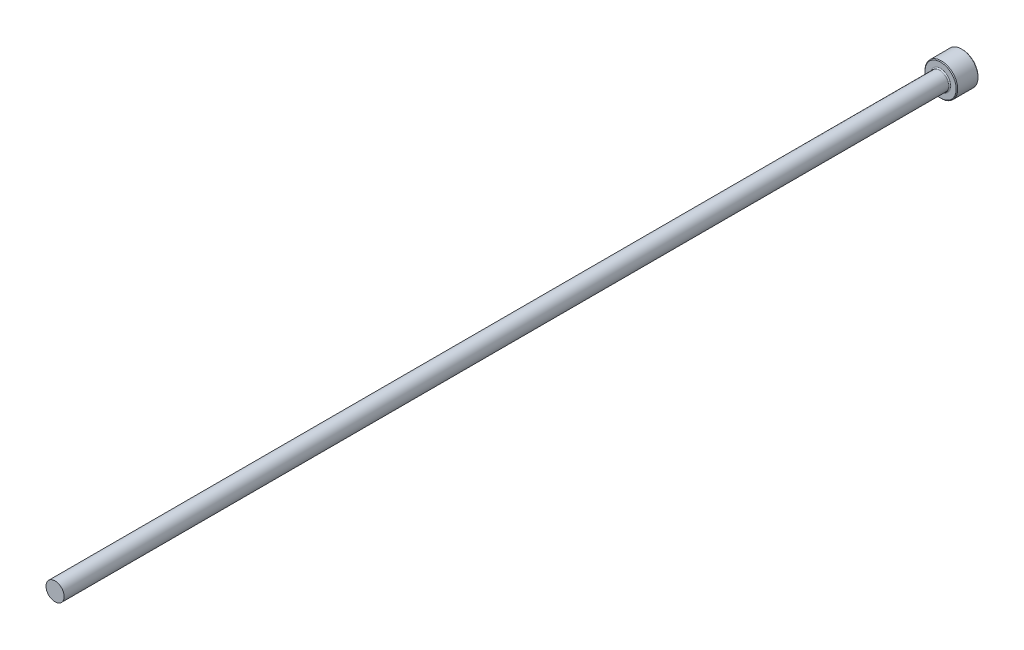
from build123d import *

# Parameters (mm, degrees)
CHAMFER1_SIZE = 0.2


with BuildPart() as part:
    # Sketch1 → Revolve1 (revolve)
    with BuildSketch(Plane(origin=(0, 0, 0), x_dir=(0, 0, -1), z_dir=(1, 0, 0)), mode=Mode.PRIVATE) as revolve1_sk:
        with BuildLine():
            Line((0, 0), (0, 4.5))
            Line((0, 4.5), (-6, 4.5))
            Line((-6, 4.5), (-6, 2.8))
            ThreePointArc((-6, 2.8), (-6.087867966, 2.587867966), (-6.3, 2.5))
            Line((-6.3, 2.5), (-250, 2.5))
            Line((-250, 2.5), (-250, 0))
            Line((-250, 0), (0, 0))
        make_face()
    revolve(revolve1_sk.sketch.rotate(Axis((0, 0, 109.05062828), (0, 0, -1)), 90), axis=Axis((0, 0, 109.05062828), (0, 0, -1)))

    # Chamfer1
    chamfer1_edges = [part.edges().sort_by_distance(p)[0] for p in [
        (-4.5, 0, 0),
        (-4.5, 0, 6),
    ]]
    chamfer(chamfer1_edges, length=CHAMFER1_SIZE)


solid = part.part
